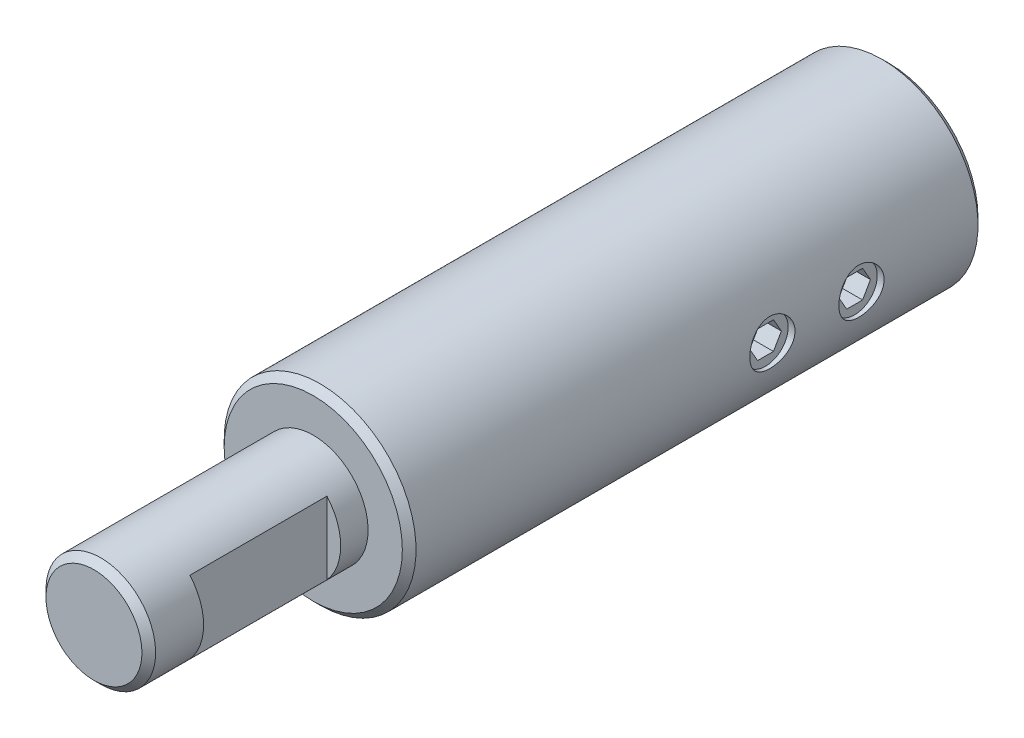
ISO-10303-21;
HEADER;
FILE_DESCRIPTION(('STEP AP214'),'2;1');
FILE_NAME('part.step','',(''),(''),'','','');
FILE_SCHEMA(('AUTOMOTIVE_DESIGN { 1 0 10303 214 1 1 1 1 }'));
ENDSEC;
DATA;
#1=APPLICATION_CONTEXT('core data for automotive mechanical design processes');
#2=APPLICATION_PROTOCOL_DEFINITION('international standard','automotive_design',2000,#1);
#3=PRODUCT_CONTEXT('',#1,'mechanical');
#4=PRODUCT('Part','Part','',(#3));
#5=PRODUCT_RELATED_PRODUCT_CATEGORY('part','',(#4));
#6=PRODUCT_DEFINITION_FORMATION('','',#4);
#7=PRODUCT_DEFINITION_CONTEXT('part definition',#1,'design');
#8=PRODUCT_DEFINITION('design','',#6,#7);
#9=PRODUCT_DEFINITION_SHAPE('','',#8);
#10=(LENGTH_UNIT() NAMED_UNIT(*) SI_UNIT(.MILLI.,.METRE.));
#11=(NAMED_UNIT(*) PLANE_ANGLE_UNIT() SI_UNIT($,.RADIAN.));
#12=(NAMED_UNIT(*) SI_UNIT($,.STERADIAN.) SOLID_ANGLE_UNIT());
#13=UNCERTAINTY_MEASURE_WITH_UNIT(LENGTH_MEASURE(1.E-05),#10,'distance_accuracy_value','');
#14=(GEOMETRIC_REPRESENTATION_CONTEXT(3) GLOBAL_UNCERTAINTY_ASSIGNED_CONTEXT((#13)) GLOBAL_UNIT_ASSIGNED_CONTEXT((#10,
#11,#12)) REPRESENTATION_CONTEXT('',''));
#15=CARTESIAN_POINT('',(0.,0.,0.));
#16=DIRECTION('',(0.,0.,1.));
#17=DIRECTION('',(1.,0.,0.));
#18=AXIS2_PLACEMENT_3D('',#15,#16,#17);
#19=CARTESIAN_POINT('',(5.,0.,10.1547005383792));
#20=DIRECTION('',(1.,0.,0.));
#21=DIRECTION('',(0.,1.,0.));
#22=AXIS2_PLACEMENT_3D('',#19,#20,#21);
#23=PLANE('',#22);
#24=DIRECTION('',(0.,-0.866025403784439,0.5));
#25=VECTOR('',#24,1.);
#26=CARTESIAN_POINT('',(5.,1.,9.57735026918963));
#27=LINE('',#26,#25);
#28=CARTESIAN_POINT('',(5.,1.,9.57735026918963));
#29=VERTEX_POINT('',#28);
#30=CARTESIAN_POINT('',(5.,0.,10.1547005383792));
#31=VERTEX_POINT('',#30);
#32=EDGE_CURVE('E117',#29,#31,#27,.T.);
#33=ORIENTED_EDGE('',*,*,#32,.T.);
#34=DIRECTION('',(0.,-0.866025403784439,-0.5));
#35=VECTOR('',#34,1.);
#36=CARTESIAN_POINT('',(5.,0.,10.1547005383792));
#37=LINE('',#36,#35);
#38=CARTESIAN_POINT('',(5.,-1.,9.57735026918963));
#39=VERTEX_POINT('',#38);
#40=EDGE_CURVE('E210',#31,#39,#37,.T.);
#41=ORIENTED_EDGE('',*,*,#40,.T.);
#42=DIRECTION('',(0.,0.,-1.));
#43=VECTOR('',#42,1.);
#44=CARTESIAN_POINT('',(5.,-1.,9.57735026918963));
#45=LINE('',#44,#43);
#46=CARTESIAN_POINT('',(5.,-1.,8.42264973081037));
#47=VERTEX_POINT('',#46);
#48=EDGE_CURVE('E213',#39,#47,#45,.T.);
#49=ORIENTED_EDGE('',*,*,#48,.T.);
#50=DIRECTION('',(0.,0.866025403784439,-0.5));
#51=VECTOR('',#50,1.);
#52=CARTESIAN_POINT('',(5.,-1.,8.42264973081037));
#53=LINE('',#52,#51);
#54=CARTESIAN_POINT('',(5.,0.,7.84529946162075));
#55=VERTEX_POINT('',#54);
#56=EDGE_CURVE('E216',#47,#55,#53,.T.);
#57=ORIENTED_EDGE('',*,*,#56,.T.);
#58=DIRECTION('',(0.,0.866025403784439,0.5));
#59=VECTOR('',#58,1.);
#60=CARTESIAN_POINT('',(5.,0.,7.84529946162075));
#61=LINE('',#60,#59);
#62=CARTESIAN_POINT('',(5.,1.,8.42264973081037));
#63=VERTEX_POINT('',#62);
#64=EDGE_CURVE('E218',#55,#63,#61,.T.);
#65=ORIENTED_EDGE('',*,*,#64,.T.);
#66=DIRECTION('',(0.,0.,1.));
#67=VECTOR('',#66,1.);
#68=CARTESIAN_POINT('',(5.,1.,8.42264973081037));
#69=LINE('',#68,#67);
#70=EDGE_CURVE('E142',#63,#29,#69,.T.);
#71=ORIENTED_EDGE('',*,*,#70,.T.);
#72=EDGE_LOOP('',(#33,#41,#49,#57,#65,#71));
#73=FACE_BOUND('',#72,.T.);
#74=ADVANCED_FACE('F14',(#73),#23,.T.);
#75=CARTESIAN_POINT('',(5.,0.,10.1547005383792));
#76=DIRECTION('',(0.,-0.5,0.866025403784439));
#77=DIRECTION('',(0.,-0.866025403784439,-0.5));
#78=AXIS2_PLACEMENT_3D('',#75,#76,#77);
#79=PLANE('',#78);
#80=DIRECTION('',(0.,-0.866025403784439,-0.5));
#81=VECTOR('',#80,1.);
#82=CARTESIAN_POINT('',(6.5,0.,10.1547005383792));
#83=LINE('',#82,#81);
#84=CARTESIAN_POINT('',(6.5,0.,10.1547005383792));
#85=VERTEX_POINT('',#84);
#86=CARTESIAN_POINT('',(6.5,-1.,9.57735026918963));
#87=VERTEX_POINT('',#86);
#88=EDGE_CURVE('E137',#85,#87,#83,.T.);
#89=ORIENTED_EDGE('',*,*,#88,.T.);
#90=DIRECTION('',(1.,0.,0.));
#91=VECTOR('',#90,1.);
#92=CARTESIAN_POINT('',(5.,-1.,9.57735026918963));
#93=LINE('',#92,#91);
#94=EDGE_CURVE('E156',#39,#87,#93,.T.);
#95=ORIENTED_EDGE('',*,*,#94,.F.);
#96=ORIENTED_EDGE('',*,*,#40,.F.);
#97=DIRECTION('',(1.,0.,0.));
#98=VECTOR('',#97,1.);
#99=CARTESIAN_POINT('',(5.,0.,10.1547005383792));
#100=LINE('',#99,#98);
#101=EDGE_CURVE('E158',#31,#85,#100,.T.);
#102=ORIENTED_EDGE('',*,*,#101,.T.);
#103=EDGE_LOOP('',(#89,#95,#96,#102));
#104=FACE_BOUND('',#103,.T.);
#105=ADVANCED_FACE('F225',(#104),#79,.F.);
#106=CARTESIAN_POINT('',(5.,-1.,9.57735026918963));
#107=DIRECTION('',(0.,-1.,0.));
#108=DIRECTION('',(1.,0.,0.));
#109=AXIS2_PLACEMENT_3D('',#106,#107,#108);
#110=PLANE('',#109);
#111=DIRECTION('',(0.,0.,-1.));
#112=VECTOR('',#111,1.);
#113=CARTESIAN_POINT('',(6.5,-1.,9.57735026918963));
#114=LINE('',#113,#112);
#115=CARTESIAN_POINT('',(6.5,-1.,8.42264973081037));
#116=VERTEX_POINT('',#115);
#117=EDGE_CURVE('E139',#87,#116,#114,.T.);
#118=ORIENTED_EDGE('',*,*,#117,.T.);
#119=DIRECTION('',(1.,0.,0.));
#120=VECTOR('',#119,1.);
#121=CARTESIAN_POINT('',(5.,-1.,8.42264973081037));
#122=LINE('',#121,#120);
#123=EDGE_CURVE('E154',#47,#116,#122,.T.);
#124=ORIENTED_EDGE('',*,*,#123,.F.);
#125=ORIENTED_EDGE('',*,*,#48,.F.);
#126=ORIENTED_EDGE('',*,*,#94,.T.);
#127=EDGE_LOOP('',(#118,#124,#125,#126));
#128=FACE_BOUND('',#127,.T.);
#129=ADVANCED_FACE('F227',(#128),#110,.F.);
#130=CARTESIAN_POINT('',(5.,-1.,8.42264973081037));
#131=DIRECTION('',(0.,-0.5,-0.866025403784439));
#132=DIRECTION('',(0.,0.866025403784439,-0.5));
#133=AXIS2_PLACEMENT_3D('',#130,#131,#132);
#134=PLANE('',#133);
#135=DIRECTION('',(0.,0.866025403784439,-0.5));
#136=VECTOR('',#135,1.);
#137=CARTESIAN_POINT('',(6.5,-1.,8.42264973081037));
#138=LINE('',#137,#136);
#139=CARTESIAN_POINT('',(6.5,0.,7.84529946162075));
#140=VERTEX_POINT('',#139);
#141=EDGE_CURVE('E147',#116,#140,#138,.T.);
#142=ORIENTED_EDGE('',*,*,#141,.T.);
#143=DIRECTION('',(1.,0.,0.));
#144=VECTOR('',#143,1.);
#145=CARTESIAN_POINT('',(5.,0.,7.84529946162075));
#146=LINE('',#145,#144);
#147=EDGE_CURVE('E152',#55,#140,#146,.T.);
#148=ORIENTED_EDGE('',*,*,#147,.F.);
#149=ORIENTED_EDGE('',*,*,#56,.F.);
#150=ORIENTED_EDGE('',*,*,#123,.T.);
#151=EDGE_LOOP('',(#142,#148,#149,#150));
#152=FACE_BOUND('',#151,.T.);
#153=ADVANCED_FACE('F231',(#152),#134,.F.);
#154=CARTESIAN_POINT('',(5.,0.,7.84529946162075));
#155=DIRECTION('',(0.,0.5,-0.866025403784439));
#156=DIRECTION('',(0.,0.866025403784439,0.5));
#157=AXIS2_PLACEMENT_3D('',#154,#155,#156);
#158=PLANE('',#157);
#159=DIRECTION('',(0.,0.866025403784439,0.5));
#160=VECTOR('',#159,1.);
#161=CARTESIAN_POINT('',(6.5,0.,7.84529946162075));
#162=LINE('',#161,#160);
#163=CARTESIAN_POINT('',(6.5,1.,8.42264973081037));
#164=VERTEX_POINT('',#163);
#165=EDGE_CURVE('E130',#140,#164,#162,.T.);
#166=ORIENTED_EDGE('',*,*,#165,.T.);
#167=DIRECTION('',(1.,0.,0.));
#168=VECTOR('',#167,1.);
#169=CARTESIAN_POINT('',(5.,1.,8.42264973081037));
#170=LINE('',#169,#168);
#171=EDGE_CURVE('E122',#63,#164,#170,.T.);
#172=ORIENTED_EDGE('',*,*,#171,.F.);
#173=ORIENTED_EDGE('',*,*,#64,.F.);
#174=ORIENTED_EDGE('',*,*,#147,.T.);
#175=EDGE_LOOP('',(#166,#172,#173,#174));
#176=FACE_BOUND('',#175,.T.);
#177=ADVANCED_FACE('F233',(#176),#158,.F.);
#178=CARTESIAN_POINT('',(5.,1.,8.42264973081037));
#179=DIRECTION('',(0.,1.,0.));
#180=DIRECTION('',(-1.,0.,0.));
#181=AXIS2_PLACEMENT_3D('',#178,#179,#180);
#182=PLANE('',#181);
#183=DIRECTION('',(0.,0.,1.));
#184=VECTOR('',#183,1.);
#185=CARTESIAN_POINT('',(6.5,1.,8.42264973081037));
#186=LINE('',#185,#184);
#187=CARTESIAN_POINT('',(6.5,1.,9.57735026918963));
#188=VERTEX_POINT('',#187);
#189=EDGE_CURVE('E125',#164,#188,#186,.T.);
#190=ORIENTED_EDGE('',*,*,#189,.T.);
#191=DIRECTION('',(1.,0.,0.));
#192=VECTOR('',#191,1.);
#193=CARTESIAN_POINT('',(5.,1.,9.57735026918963));
#194=LINE('',#193,#192);
#195=EDGE_CURVE('E110',#29,#188,#194,.T.);
#196=ORIENTED_EDGE('',*,*,#195,.F.);
#197=ORIENTED_EDGE('',*,*,#70,.F.);
#198=ORIENTED_EDGE('',*,*,#171,.T.);
#199=EDGE_LOOP('',(#190,#196,#197,#198));
#200=FACE_BOUND('',#199,.T.);
#201=ADVANCED_FACE('F126',(#200),#182,.F.);
#202=CARTESIAN_POINT('',(5.,1.,9.57735026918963));
#203=DIRECTION('',(0.,0.5,0.866025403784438));
#204=DIRECTION('',(0.,-0.866025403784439,0.5));
#205=AXIS2_PLACEMENT_3D('',#202,#203,#204);
#206=PLANE('',#205);
#207=DIRECTION('',(0.,-0.866025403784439,0.5));
#208=VECTOR('',#207,1.);
#209=CARTESIAN_POINT('',(6.5,1.,9.57735026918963));
#210=LINE('',#209,#208);
#211=EDGE_CURVE('E114',#188,#85,#210,.T.);
#212=ORIENTED_EDGE('',*,*,#211,.T.);
#213=ORIENTED_EDGE('',*,*,#101,.F.);
#214=ORIENTED_EDGE('',*,*,#32,.F.);
#215=ORIENTED_EDGE('',*,*,#195,.T.);
#216=EDGE_LOOP('',(#212,#213,#214,#215));
#217=FACE_BOUND('',#216,.T.);
#218=ADVANCED_FACE('F112',(#217),#206,.F.);
#219=CARTESIAN_POINT('',(6.5,0.,11.));
#220=DIRECTION('',(1.,0.,0.));
#221=DIRECTION('',(0.,0.,-1.));
#222=AXIS2_PLACEMENT_3D('',#219,#220,#221);
#223=PLANE('',#222);
#224=ORIENTED_EDGE('',*,*,#211,.F.);
#225=ORIENTED_EDGE('',*,*,#189,.F.);
#226=ORIENTED_EDGE('',*,*,#165,.F.);
#227=ORIENTED_EDGE('',*,*,#141,.F.);
#228=ORIENTED_EDGE('',*,*,#117,.F.);
#229=ORIENTED_EDGE('',*,*,#88,.F.);
#230=EDGE_LOOP('',(#224,#225,#226,#227,#228,#229));
#231=FACE_BOUND('',#230,.T.);
#232=CARTESIAN_POINT('',(6.5,0.,9.));
#233=DIRECTION('',(1.,0.,0.));
#234=DIRECTION('',(0.,1.,0.));
#235=AXIS2_PLACEMENT_3D('',#232,#233,#234);
#236=CIRCLE('',#235,1.65);
#237=CARTESIAN_POINT('',(6.5,1.65,9.));
#238=VERTEX_POINT('',#237);
#239=EDGE_CURVE('E394',#238,#238,#236,.F.);
#240=ORIENTED_EDGE('',*,*,#239,.F.);
#241=EDGE_LOOP('',(#240));
#242=FACE_BOUND('',#241,.T.);
#243=ADVANCED_FACE('F133',(#231,#242),#223,.T.);
#244=CARTESIAN_POINT('',(2.5,0.,9.));
#245=DIRECTION('',(-1.,0.,0.));
#246=DIRECTION('',(0.,0.,1.));
#247=AXIS2_PLACEMENT_3D('',#244,#245,#246);
#248=CYLINDRICAL_SURFACE('',#247,2.);
#249=CARTESIAN_POINT('',(3.25,0.,9.));
#250=DIRECTION('',(-1.,0.,0.));
#251=DIRECTION('',(0.,0.,1.));
#252=AXIS2_PLACEMENT_3D('',#249,#250,#251);
#253=CIRCLE('',#252,2.);
#254=CARTESIAN_POINT('',(3.25,0.,11.));
#255=VERTEX_POINT('',#254);
#256=EDGE_CURVE('E121',#255,#255,#253,.T.);
#257=ORIENTED_EDGE('',*,*,#256,.F.);
#258=EDGE_LOOP('',(#257));
#259=FACE_BOUND('',#258,.T.);
#260=CARTESIAN_POINT('',(4.,0.,11.));
#261=CARTESIAN_POINT('',(3.99999426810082,-0.105143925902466,10.9999933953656));
#262=CARTESIAN_POINT('',(3.99580982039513,-0.210413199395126,10.9916598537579));
#263=CARTESIAN_POINT('',(3.97948312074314,-0.417840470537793,10.9586942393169));
#264=CARTESIAN_POINT('',(3.96732575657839,-0.519992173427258,10.9340312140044));
#265=CARTESIAN_POINT('',(3.93632558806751,-0.717867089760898,10.8696123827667));
#266=CARTESIAN_POINT('',(3.91750878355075,-0.813613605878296,10.8299152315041));
#267=CARTESIAN_POINT('',(3.87491553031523,-0.996945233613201,10.73685875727));
#268=CARTESIAN_POINT('',(3.85113947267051,-1.08453098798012,10.6835005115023));
#269=CARTESIAN_POINT('',(3.79912516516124,-1.25501563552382,10.5609655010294));
#270=CARTESIAN_POINT('',(3.77070398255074,-1.33731042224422,10.4910270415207));
#271=CARTESIAN_POINT('',(3.71319940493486,-1.48955888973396,10.3389570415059));
#272=CARTESIAN_POINT('',(3.68411552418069,-1.55950316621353,10.2568162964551));
#273=CARTESIAN_POINT('',(3.62597902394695,-1.69050400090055,10.0750333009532));
#274=CARTESIAN_POINT('',(3.59710373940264,-1.75045067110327,9.97452780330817));
#275=CARTESIAN_POINT('',(3.54571957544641,-1.85233645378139,9.76326532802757));
#276=CARTESIAN_POINT('',(3.52320615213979,-1.89428842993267,9.6525157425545));
#277=CARTESIAN_POINT('',(3.48915734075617,-1.95626488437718,9.43066978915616));
#278=CARTESIAN_POINT('',(3.47704543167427,-1.97745171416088,9.31999109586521));
#279=CARTESIAN_POINT('',(3.46363779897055,-2.00085398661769,9.09604232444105));
#280=CARTESIAN_POINT('',(3.46233138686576,-2.00308817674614,8.98277491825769));
#281=CARTESIAN_POINT('',(3.47021860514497,-1.98937457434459,8.77142795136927));
#282=CARTESIAN_POINT('',(3.47817527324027,-1.97556911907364,8.6731519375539));
#283=CARTESIAN_POINT('',(3.50152457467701,-1.93387969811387,8.48055618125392));
#284=CARTESIAN_POINT('',(3.51691957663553,-1.9059912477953,8.38623770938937));
#285=CARTESIAN_POINT('',(3.55374952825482,-1.83641956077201,8.20154173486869));
#286=CARTESIAN_POINT('',(3.57531681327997,-1.79443013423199,8.11130720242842));
#287=CARTESIAN_POINT('',(3.62206808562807,-1.69808337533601,7.93873141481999));
#288=CARTESIAN_POINT('',(3.64725369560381,-1.64372048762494,7.85639372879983));
#289=CARTESIAN_POINT('',(3.70226315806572,-1.51613210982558,7.69095749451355));
#290=CARTESIAN_POINT('',(3.73227020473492,-1.44138891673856,7.60908625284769));
#291=CARTESIAN_POINT('',(3.79095246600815,-1.27911115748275,7.4585291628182));
#292=CARTESIAN_POINT('',(3.81962703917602,-1.19157051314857,7.38984961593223));
#293=CARTESIAN_POINT('',(3.87403974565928,-1.0010330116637,7.26462867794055));
#294=CARTESIAN_POINT('',(3.89957968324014,-0.897507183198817,7.20879905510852));
#295=CARTESIAN_POINT('',(3.94315762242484,-0.680932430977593,7.11580594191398));
#296=CARTESIAN_POINT('',(3.96120157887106,-0.567891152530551,7.07862762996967));
#297=CARTESIAN_POINT('',(3.98648667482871,-0.345532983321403,7.02704919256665));
#298=CARTESIAN_POINT('',(3.9944987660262,-0.236683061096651,7.01101752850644));
#299=CARTESIAN_POINT('',(4.00146026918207,-0.0175591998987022,6.99707053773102));
#300=CARTESIAN_POINT('',(4.00041397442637,0.0927140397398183,6.99914662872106));
#301=CARTESIAN_POINT('',(3.9898238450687,0.302465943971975,7.02041337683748));
#302=CARTESIAN_POINT('',(3.98094491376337,0.402118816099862,7.03826506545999));
#303=CARTESIAN_POINT('',(3.9564434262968,0.596813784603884,7.08847614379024));
#304=CARTESIAN_POINT('',(3.94082012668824,0.691855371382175,7.12083713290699));
#305=CARTESIAN_POINT('',(3.90368502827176,0.877777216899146,7.19999693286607));
#306=CARTESIAN_POINT('',(3.88201763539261,0.968460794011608,7.24718210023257));
#307=CARTESIAN_POINT('',(3.83487948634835,1.14092272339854,7.35421507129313));
#308=CARTESIAN_POINT('',(3.80940711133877,1.22269725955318,7.41406826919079));
#309=CARTESIAN_POINT('',(3.75416442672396,1.38353537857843,7.55152085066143));
#310=CARTESIAN_POINT('',(3.72421769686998,1.46154415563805,7.63028573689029));
#311=CARTESIAN_POINT('',(3.6652478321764,1.60371264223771,7.79985030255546));
#312=CARTESIAN_POINT('',(3.63622534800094,1.66786277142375,7.89065823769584));
#313=CARTESIAN_POINT('',(3.58102384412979,1.78341582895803,8.08728730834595));
#314=CARTESIAN_POINT('',(3.55505059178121,1.8340509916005,8.19362253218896));
#315=CARTESIAN_POINT('',(3.51148144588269,1.91616565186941,8.41502013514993));
#316=CARTESIAN_POINT('',(3.493874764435,1.94766983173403,8.53007105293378));
#317=CARTESIAN_POINT('',(3.47123002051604,1.98772337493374,8.75382044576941));
#318=CARTESIAN_POINT('',(3.4651476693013,1.9981859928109,8.86206850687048));
#319=CARTESIAN_POINT('',(3.46330709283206,2.00137830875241,9.07889413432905));
#320=CARTESIAN_POINT('',(3.4675443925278,1.99411569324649,9.18747153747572));
#321=CARTESIAN_POINT('',(3.48475724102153,1.96385225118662,9.39096700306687));
#322=CARTESIAN_POINT('',(3.49686188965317,1.94241662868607,9.48620094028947));
#323=CARTESIAN_POINT('',(3.52742032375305,1.88635071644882,9.67161623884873));
#324=CARTESIAN_POINT('',(3.54587615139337,1.85171618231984,9.76179596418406));
#325=CARTESIAN_POINT('',(3.58857060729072,1.76763149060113,9.94124970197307));
#326=CARTESIAN_POINT('',(3.61311444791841,1.7173422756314,10.0300558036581));
#327=CARTESIAN_POINT('',(3.66470663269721,1.60430194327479,10.1985490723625));
#328=CARTESIAN_POINT('',(3.69175627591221,1.54154434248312,10.2782314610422));
#329=CARTESIAN_POINT('',(3.74924646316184,1.39640665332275,10.4362839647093));
#330=CARTESIAN_POINT('',(3.77969966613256,1.31256884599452,10.5133182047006));
#331=CARTESIAN_POINT('',(3.83755504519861,1.1323096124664,10.6525259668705));
#332=CARTESIAN_POINT('',(3.8649555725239,1.0358814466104,10.7146914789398));
#333=CARTESIAN_POINT('',(3.91396019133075,0.83186319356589,10.8224727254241));
#334=CARTESIAN_POINT('',(3.93552192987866,0.724199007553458,10.8679683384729));
#335=CARTESIAN_POINT('',(3.97002682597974,0.501484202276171,10.9396163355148));
#336=CARTESIAN_POINT('',(3.98299446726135,0.386455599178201,10.9658236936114));
#337=CARTESIAN_POINT('',(3.99390923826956,0.225203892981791,10.9877948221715));
#338=CARTESIAN_POINT('',(3.99618730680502,0.180323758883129,10.9923652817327));
#339=CARTESIAN_POINT('',(3.99923393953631,0.0903034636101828,10.9984693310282));
#340=CARTESIAN_POINT('',(4.00000246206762,0.0451632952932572,11.0000028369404));
#341=CARTESIAN_POINT('',(4.,0.,11.));
#342=B_SPLINE_CURVE_WITH_KNOTS('',3,(#260,#261,#262,#263,#264,#265,#266,#267,#268,#269,#270,
#271,#272,#273,#274,#275,#276,#277,#278,#279,#280,#281,#282,#283,#284,#285,#286,#287,#288,#289,
#290,#291,#292,#293,#294,#295,#296,#297,#298,#299,#300,#301,#302,#303,#304,#305,#306,#307,#308,
#309,#310,#311,#312,#313,#314,#315,#316,#317,#318,#319,#320,#321,#322,#323,#324,#325,#326,#327,
#328,#329,#330,#331,#332,#333,#334,#335,#336,#337,#338,#339,#340,#341),.UNSPECIFIED.,.T.,.F.,(4,
2,2,2,2,2,2,2,2,2,2,2,2,2,2,2,2,2,2,2,2,2,2,2,2,2,2,2,2,2,2,2,2,2,2,2,2,2,2,2,4),(0.,
0.315248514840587,0.631096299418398,0.9457243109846,1.26032752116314,1.59396351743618,
1.92785247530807,2.28763452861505,2.64715895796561,2.98516024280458,3.3228271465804,
3.6201142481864,3.91749607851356,4.22180480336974,4.52625042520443,4.86929882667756,
5.21251069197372,5.57166044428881,5.93052433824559,6.25966580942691,6.58865129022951,
6.89213813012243,7.19565843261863,7.50785712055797,7.82018901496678,8.16319221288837,
8.50643177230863,8.86629364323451,9.22569023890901,9.55058615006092,9.87534119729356,
10.1691586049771,10.463070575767,10.7767291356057,11.0905512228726,11.4425048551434,
11.7946476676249,12.1492802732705,12.502898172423,12.6383056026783,12.7737167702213),.UNSPECIFIED.);
#343=CARTESIAN_POINT('',(4.,0.,11.));
#344=VERTEX_POINT('',#343);
#345=EDGE_CURVE('E24',#344,#344,#342,.T.);
#346=ORIENTED_EDGE('',*,*,#345,.F.);
#347=EDGE_LOOP('',(#346));
#348=FACE_BOUND('',#347,.T.);
#349=ADVANCED_FACE('F317',(#259,#348),#248,.T.);
#350=CARTESIAN_POINT('',(2.5,0.,9.));
#351=DIRECTION('',(-1.,0.,0.));
#352=DIRECTION('',(0.,0.,1.));
#353=AXIS2_PLACEMENT_3D('',#350,#351,#352);
#354=PLANE('',#353);
#355=CARTESIAN_POINT('',(2.5,0.,9.));
#356=DIRECTION('',(-1.,0.,0.));
#357=DIRECTION('',(0.,0.,1.));
#358=AXIS2_PLACEMENT_3D('',#355,#356,#357);
#359=CIRCLE('',#358,1.25);
#360=CARTESIAN_POINT('',(2.5,0.,10.25));
#361=VERTEX_POINT('',#360);
#362=EDGE_CURVE('E18',#361,#361,#359,.T.);
#363=ORIENTED_EDGE('',*,*,#362,.T.);
#364=EDGE_LOOP('',(#363));
#365=FACE_BOUND('',#364,.T.);
#366=ADVANCED_FACE('F16',(#365),#354,.T.);
#367=CARTESIAN_POINT('',(2.5,0.,9.));
#368=DIRECTION('',(1.,0.,0.));
#369=DIRECTION('',(0.,0.,-1.));
#370=AXIS2_PLACEMENT_3D('',#367,#368,#369);
#371=CONICAL_SURFACE('',#370,1.25,0.78539816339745);
#372=ORIENTED_EDGE('',*,*,#256,.T.);
#373=EDGE_LOOP('',(#372));
#374=FACE_BOUND('',#373,.T.);
#375=ORIENTED_EDGE('',*,*,#362,.F.);
#376=EDGE_LOOP('',(#375));
#377=FACE_BOUND('',#376,.T.);
#378=ADVANCED_FACE('F288',(#374,#377),#371,.T.);
#379=CARTESIAN_POINT('',(5.,-1.,14.9226497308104));
#380=DIRECTION('',(1.,0.,0.));
#381=DIRECTION('',(0.,-0.5,0.866025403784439));
#382=AXIS2_PLACEMENT_3D('',#379,#380,#381);
#383=PLANE('',#382);
#384=DIRECTION('',(0.,0.,-1.));
#385=VECTOR('',#384,1.);
#386=CARTESIAN_POINT('',(5.,-1.,16.0773502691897));
#387=LINE('',#386,#385);
#388=CARTESIAN_POINT('',(5.,-1.,16.0773502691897));
#389=VERTEX_POINT('',#388);
#390=CARTESIAN_POINT('',(5.,-1.,14.9226497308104));
#391=VERTEX_POINT('',#390);
#392=EDGE_CURVE('E189',#389,#391,#387,.T.);
#393=ORIENTED_EDGE('',*,*,#392,.T.);
#394=DIRECTION('',(0.,0.866025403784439,-0.5));
#395=VECTOR('',#394,1.);
#396=CARTESIAN_POINT('',(5.,-1.,14.9226497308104));
#397=LINE('',#396,#395);
#398=CARTESIAN_POINT('',(5.,0.,14.3452994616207));
#399=VERTEX_POINT('',#398);
#400=EDGE_CURVE('E722',#391,#399,#397,.T.);
#401=ORIENTED_EDGE('',*,*,#400,.T.);
#402=DIRECTION('',(0.,0.866025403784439,0.5));
#403=VECTOR('',#402,1.);
#404=CARTESIAN_POINT('',(5.,0.,14.3452994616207));
#405=LINE('',#404,#403);
#406=CARTESIAN_POINT('',(5.,1.,14.9226497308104));
#407=VERTEX_POINT('',#406);
#408=EDGE_CURVE('E725',#399,#407,#405,.T.);
#409=ORIENTED_EDGE('',*,*,#408,.T.);
#410=DIRECTION('',(0.,0.,1.));
#411=VECTOR('',#410,1.);
#412=CARTESIAN_POINT('',(5.,1.,14.9226497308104));
#413=LINE('',#412,#411);
#414=CARTESIAN_POINT('',(5.,1.,16.0773502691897));
#415=VERTEX_POINT('',#414);
#416=EDGE_CURVE('E728',#407,#415,#413,.T.);
#417=ORIENTED_EDGE('',*,*,#416,.T.);
#418=DIRECTION('',(0.,-0.866025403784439,0.5));
#419=VECTOR('',#418,1.);
#420=CARTESIAN_POINT('',(5.,1.,16.0773502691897));
#421=LINE('',#420,#419);
#422=CARTESIAN_POINT('',(5.,0.,16.6547005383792));
#423=VERTEX_POINT('',#422);
#424=EDGE_CURVE('E730',#415,#423,#421,.T.);
#425=ORIENTED_EDGE('',*,*,#424,.T.);
#426=DIRECTION('',(0.,-0.866025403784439,-0.5));
#427=VECTOR('',#426,1.);
#428=CARTESIAN_POINT('',(5.,0.,16.6547005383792));
#429=LINE('',#428,#427);
#430=EDGE_CURVE('E175',#423,#389,#429,.T.);
#431=ORIENTED_EDGE('',*,*,#430,.T.);
#432=EDGE_LOOP('',(#393,#401,#409,#417,#425,#431));
#433=FACE_BOUND('',#432,.T.);
#434=ADVANCED_FACE('F284',(#433),#383,.T.);
#435=CARTESIAN_POINT('',(5.,-1.,14.9226497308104));
#436=DIRECTION('',(0.,-0.5,-0.866025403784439));
#437=DIRECTION('',(0.,0.866025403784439,-0.5));
#438=AXIS2_PLACEMENT_3D('',#435,#436,#437);
#439=PLANE('',#438);
#440=DIRECTION('',(0.,0.866025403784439,-0.5));
#441=VECTOR('',#440,1.);
#442=CARTESIAN_POINT('',(6.5,-1.,14.9226497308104));
#443=LINE('',#442,#441);
#444=CARTESIAN_POINT('',(6.5,-1.,14.9226497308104));
#445=VERTEX_POINT('',#444);
#446=CARTESIAN_POINT('',(6.5,0.,14.3452994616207));
#447=VERTEX_POINT('',#446);
#448=EDGE_CURVE('E166',#445,#447,#443,.T.);
#449=ORIENTED_EDGE('',*,*,#448,.T.);
#450=DIRECTION('',(1.,0.,0.));
#451=VECTOR('',#450,1.);
#452=CARTESIAN_POINT('',(5.,0.,14.3452994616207));
#453=LINE('',#452,#451);
#454=EDGE_CURVE('E199',#399,#447,#453,.T.);
#455=ORIENTED_EDGE('',*,*,#454,.F.);
#456=ORIENTED_EDGE('',*,*,#400,.F.);
#457=DIRECTION('',(1.,0.,0.));
#458=VECTOR('',#457,1.);
#459=CARTESIAN_POINT('',(5.,-1.,14.9226497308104));
#460=LINE('',#459,#458);
#461=EDGE_CURVE('E201',#391,#445,#460,.T.);
#462=ORIENTED_EDGE('',*,*,#461,.T.);
#463=EDGE_LOOP('',(#449,#455,#456,#462));
#464=FACE_BOUND('',#463,.T.);
#465=ADVANCED_FACE('F287',(#464),#439,.F.);
#466=CARTESIAN_POINT('',(5.,0.,14.3452994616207));
#467=DIRECTION('',(0.,0.5,-0.866025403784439));
#468=DIRECTION('',(1.,0.,0.));
#469=AXIS2_PLACEMENT_3D('',#466,#467,#468);
#470=PLANE('',#469);
#471=DIRECTION('',(0.,0.866025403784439,0.5));
#472=VECTOR('',#471,1.);
#473=CARTESIAN_POINT('',(6.5,0.,14.3452994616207));
#474=LINE('',#473,#472);
#475=CARTESIAN_POINT('',(6.5,1.,14.9226497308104));
#476=VERTEX_POINT('',#475);
#477=EDGE_CURVE('E172',#447,#476,#474,.T.);
#478=ORIENTED_EDGE('',*,*,#477,.T.);
#479=DIRECTION('',(1.,0.,0.));
#480=VECTOR('',#479,1.);
#481=CARTESIAN_POINT('',(5.,1.,14.9226497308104));
#482=LINE('',#481,#480);
#483=EDGE_CURVE('E197',#407,#476,#482,.T.);
#484=ORIENTED_EDGE('',*,*,#483,.F.);
#485=ORIENTED_EDGE('',*,*,#408,.F.);
#486=ORIENTED_EDGE('',*,*,#454,.T.);
#487=EDGE_LOOP('',(#478,#484,#485,#486));
#488=FACE_BOUND('',#487,.T.);
#489=ADVANCED_FACE('F302',(#488),#470,.F.);
#490=CARTESIAN_POINT('',(5.,1.,14.9226497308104));
#491=DIRECTION('',(0.,1.,0.));
#492=DIRECTION('',(0.,0.,1.));
#493=AXIS2_PLACEMENT_3D('',#490,#491,#492);
#494=PLANE('',#493);
#495=DIRECTION('',(0.,0.,1.));
#496=VECTOR('',#495,1.);
#497=CARTESIAN_POINT('',(6.5,1.,14.9226497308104));
#498=LINE('',#497,#496);
#499=CARTESIAN_POINT('',(6.5,1.,16.0773502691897));
#500=VERTEX_POINT('',#499);
#501=EDGE_CURVE('E180',#476,#500,#498,.T.);
#502=ORIENTED_EDGE('',*,*,#501,.T.);
#503=DIRECTION('',(1.,0.,0.));
#504=VECTOR('',#503,1.);
#505=CARTESIAN_POINT('',(5.,1.,16.0773502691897));
#506=LINE('',#505,#504);
#507=EDGE_CURVE('E195',#415,#500,#506,.T.);
#508=ORIENTED_EDGE('',*,*,#507,.F.);
#509=ORIENTED_EDGE('',*,*,#416,.F.);
#510=ORIENTED_EDGE('',*,*,#483,.T.);
#511=EDGE_LOOP('',(#502,#508,#509,#510));
#512=FACE_BOUND('',#511,.T.);
#513=ADVANCED_FACE('F298',(#512),#494,.F.);
#514=CARTESIAN_POINT('',(5.,1.,16.0773502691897));
#515=DIRECTION('',(0.,0.5,0.866025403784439));
#516=DIRECTION('',(0.,-0.866025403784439,0.5));
#517=AXIS2_PLACEMENT_3D('',#514,#515,#516);
#518=PLANE('',#517);
#519=DIRECTION('',(0.,-0.866025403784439,0.5));
#520=VECTOR('',#519,1.);
#521=CARTESIAN_POINT('',(6.5,1.,16.0773502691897));
#522=LINE('',#521,#520);
#523=CARTESIAN_POINT('',(6.5,0.,16.6547005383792));
#524=VERTEX_POINT('',#523);
#525=EDGE_CURVE('E183',#500,#524,#522,.T.);
#526=ORIENTED_EDGE('',*,*,#525,.T.);
#527=DIRECTION('',(1.,0.,0.));
#528=VECTOR('',#527,1.);
#529=CARTESIAN_POINT('',(5.,0.,16.6547005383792));
#530=LINE('',#529,#528);
#531=EDGE_CURVE('E193',#423,#524,#530,.T.);
#532=ORIENTED_EDGE('',*,*,#531,.F.);
#533=ORIENTED_EDGE('',*,*,#424,.F.);
#534=ORIENTED_EDGE('',*,*,#507,.T.);
#535=EDGE_LOOP('',(#526,#532,#533,#534));
#536=FACE_BOUND('',#535,.T.);
#537=ADVANCED_FACE('F294',(#536),#518,.F.);
#538=CARTESIAN_POINT('',(5.,0.,16.6547005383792));
#539=DIRECTION('',(0.,-0.5,0.866025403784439));
#540=DIRECTION('',(-1.,0.,0.));
#541=AXIS2_PLACEMENT_3D('',#538,#539,#540);
#542=PLANE('',#541);
#543=DIRECTION('',(0.,-0.866025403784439,-0.5));
#544=VECTOR('',#543,1.);
#545=CARTESIAN_POINT('',(6.5,0.,16.6547005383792));
#546=LINE('',#545,#544);
#547=CARTESIAN_POINT('',(6.5,-1.,16.0773502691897));
#548=VERTEX_POINT('',#547);
#549=EDGE_CURVE('E186',#524,#548,#546,.T.);
#550=ORIENTED_EDGE('',*,*,#549,.T.);
#551=DIRECTION('',(1.,0.,0.));
#552=VECTOR('',#551,1.);
#553=CARTESIAN_POINT('',(5.,-1.,16.0773502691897));
#554=LINE('',#553,#552);
#555=EDGE_CURVE('E190',#389,#548,#554,.T.);
#556=ORIENTED_EDGE('',*,*,#555,.F.);
#557=ORIENTED_EDGE('',*,*,#430,.F.);
#558=ORIENTED_EDGE('',*,*,#531,.T.);
#559=EDGE_LOOP('',(#550,#556,#557,#558));
#560=FACE_BOUND('',#559,.T.);
#561=ADVANCED_FACE('F290',(#560),#542,.F.);
#562=CARTESIAN_POINT('',(5.,-1.,16.0773502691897));
#563=DIRECTION('',(0.,-1.,0.));
#564=DIRECTION('',(0.,0.,-1.));
#565=AXIS2_PLACEMENT_3D('',#562,#563,#564);
#566=PLANE('',#565);
#567=DIRECTION('',(0.,0.,-1.));
#568=VECTOR('',#567,1.);
#569=CARTESIAN_POINT('',(6.5,-1.,16.0773502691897));
#570=LINE('',#569,#568);
#571=EDGE_CURVE('E163',#548,#445,#570,.T.);
#572=ORIENTED_EDGE('',*,*,#571,.T.);
#573=ORIENTED_EDGE('',*,*,#461,.F.);
#574=ORIENTED_EDGE('',*,*,#392,.F.);
#575=ORIENTED_EDGE('',*,*,#555,.T.);
#576=EDGE_LOOP('',(#572,#573,#574,#575));
#577=FACE_BOUND('',#576,.T.);
#578=ADVANCED_FACE('F293',(#577),#566,.F.);
#579=CARTESIAN_POINT('',(6.5,-1.73205080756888,14.5));
#580=DIRECTION('',(1.,0.,0.));
#581=DIRECTION('',(0.,0.866025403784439,0.5));
#582=AXIS2_PLACEMENT_3D('',#579,#580,#581);
#583=PLANE('',#582);
#584=ORIENTED_EDGE('',*,*,#571,.F.);
#585=ORIENTED_EDGE('',*,*,#549,.F.);
#586=ORIENTED_EDGE('',*,*,#525,.F.);
#587=ORIENTED_EDGE('',*,*,#501,.F.);
#588=ORIENTED_EDGE('',*,*,#477,.F.);
#589=ORIENTED_EDGE('',*,*,#448,.F.);
#590=EDGE_LOOP('',(#584,#585,#586,#587,#588,#589));
#591=FACE_BOUND('',#590,.T.);
#592=CARTESIAN_POINT('',(6.5,0.,15.5));
#593=DIRECTION('',(1.,0.,0.));
#594=DIRECTION('',(0.,0.,1.));
#595=AXIS2_PLACEMENT_3D('',#592,#593,#594);
#596=CIRCLE('',#595,1.65);
#597=CARTESIAN_POINT('',(6.5,0.,17.15));
#598=VERTEX_POINT('',#597);
#599=EDGE_CURVE('E396',#598,#598,#596,.F.);
#600=ORIENTED_EDGE('',*,*,#599,.F.);
#601=EDGE_LOOP('',(#600));
#602=FACE_BOUND('',#601,.T.);
#603=ADVANCED_FACE('F312',(#591,#602),#583,.T.);
#604=CARTESIAN_POINT('',(2.5,0.,15.5));
#605=DIRECTION('',(-1.,0.,0.));
#606=DIRECTION('',(0.,-0.866025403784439,-0.5));
#607=AXIS2_PLACEMENT_3D('',#604,#605,#606);
#608=CYLINDRICAL_SURFACE('',#607,2.);
#609=CARTESIAN_POINT('',(3.25,0.,15.5));
#610=DIRECTION('',(-1.,0.,0.));
#611=DIRECTION('',(0.,-0.866025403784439,-0.5));
#612=AXIS2_PLACEMENT_3D('',#609,#610,#611);
#613=CIRCLE('',#612,2.);
#614=CARTESIAN_POINT('',(3.25,-1.73205080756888,14.5));
#615=VERTEX_POINT('',#614);
#616=EDGE_CURVE('E192',#615,#615,#613,.T.);
#617=ORIENTED_EDGE('',*,*,#616,.F.);
#618=EDGE_LOOP('',(#617));
#619=FACE_BOUND('',#618,.T.);
#620=CARTESIAN_POINT('',(3.60555127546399,-1.73205080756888,14.5));
#621=CARTESIAN_POINT('',(3.63330072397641,-1.6742839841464,14.3999492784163));
#622=CARTESIAN_POINT('',(3.66340889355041,-1.60804520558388,14.3052717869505));
#623=CARTESIAN_POINT('',(3.72473015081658,-1.46040741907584,14.1286809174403));
#624=CARTESIAN_POINT('',(3.75594606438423,-1.37896698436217,14.0468035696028));
#625=CARTESIAN_POINT('',(3.81605659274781,-1.20265571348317,13.8978365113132));
#626=CARTESIAN_POINT('',(3.84495025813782,-1.10777942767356,13.8307528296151));
#627=CARTESIAN_POINT('',(3.8972467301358,-0.906764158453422,13.713583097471));
#628=CARTESIAN_POINT('',(3.92065575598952,-0.800638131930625,13.6634777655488));
#629=CARTESIAN_POINT('',(3.9585333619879,-0.584425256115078,13.583973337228));
#630=CARTESIAN_POINT('',(3.97332921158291,-0.474679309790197,13.5538093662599));
#631=CARTESIAN_POINT('',(3.99370450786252,-0.250836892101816,13.5125375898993));
#632=CARTESIAN_POINT('',(3.99928959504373,-0.136743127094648,13.5014181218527));
#633=CARTESIAN_POINT('',(4.00052059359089,0.0805769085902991,13.498961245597));
#634=CARTESIAN_POINT('',(3.99707902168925,0.183782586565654,13.5058076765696));
#635=CARTESIAN_POINT('',(3.98250691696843,0.387363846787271,13.5351783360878));
#636=CARTESIAN_POINT('',(3.97137663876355,0.487739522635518,13.5577020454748));
#637=CARTESIAN_POINT('',(3.94266442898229,0.681856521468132,13.6171121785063));
#638=CARTESIAN_POINT('',(3.92515694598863,0.775660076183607,13.6538331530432));
#639=CARTESIAN_POINT('',(3.88520912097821,0.955865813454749,13.740363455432));
#640=CARTESIAN_POINT('',(3.86276744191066,1.04226598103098,13.7901763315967));
#641=CARTESIAN_POINT('',(3.812752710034,1.21304818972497,13.9062456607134));
#642=CARTESIAN_POINT('',(3.78490681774,1.29664921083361,13.9735328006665));
#643=CARTESIAN_POINT('',(3.72810667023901,1.45191920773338,14.1203750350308));
#644=CARTESIAN_POINT('',(3.69915157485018,1.52357890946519,14.1999395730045));
#645=CARTESIAN_POINT('',(3.64057503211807,1.65894331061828,14.3769158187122));
#646=CARTESIAN_POINT('',(3.61109645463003,1.72150029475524,14.4752592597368));
#647=CARTESIAN_POINT('',(3.55783946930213,1.82904300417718,14.6825566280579));
#648=CARTESIAN_POINT('',(3.53405805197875,1.87403801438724,14.7915049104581));
#649=CARTESIAN_POINT('',(3.49672204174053,1.94278435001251,15.0118752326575));
#650=CARTESIAN_POINT('',(3.48273910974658,1.96743518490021,15.1229400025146));
#651=CARTESIAN_POINT('',(3.46560346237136,1.9974778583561,15.348415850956));
#652=CARTESIAN_POINT('',(3.46243843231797,2.00289159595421,15.4628229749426));
#653=CARTESIAN_POINT('',(3.46715158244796,1.99470641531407,15.6764682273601));
#654=CARTESIAN_POINT('',(3.47371297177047,1.98337510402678,15.7758331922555));
#655=CARTESIAN_POINT('',(3.49462495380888,1.946289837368,15.9709823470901));
#656=CARTESIAN_POINT('',(3.50897787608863,1.92053156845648,16.0667654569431));
#657=CARTESIAN_POINT('',(3.54385710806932,1.85538137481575,16.2532657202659));
#658=CARTESIAN_POINT('',(3.56443473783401,1.81587568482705,16.3439330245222));
#659=CARTESIAN_POINT('',(3.60953060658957,1.72449452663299,16.5177271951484));
#660=CARTESIAN_POINT('',(3.63405047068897,1.67261395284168,16.6008509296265));
#661=CARTESIAN_POINT('',(3.687995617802,1.55038171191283,16.7682096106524));
#662=CARTESIAN_POINT('',(3.71765053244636,1.47852991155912,16.851277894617));
#663=CARTESIAN_POINT('',(3.77614005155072,1.32202408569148,17.0047503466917));
#664=CARTESIAN_POINT('',(3.80497420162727,1.23736312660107,17.0751476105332));
#665=CARTESIAN_POINT('',(3.86059866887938,1.05152767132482,17.2052515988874));
#666=CARTESIAN_POINT('',(3.88717160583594,0.949677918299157,17.2640950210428));
#667=CARTESIAN_POINT('',(3.93323680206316,0.735911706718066,17.3634093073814));
#668=CARTESIAN_POINT('',(3.95273415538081,0.62400256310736,17.4038933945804));
#669=CARTESIAN_POINT('',(3.98116274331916,0.402329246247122,17.4622059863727));
#670=CARTESIAN_POINT('',(3.99078295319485,0.293045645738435,17.481519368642));
#671=CARTESIAN_POINT('',(4.00086617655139,0.0723913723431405,17.5017526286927));
#672=CARTESIAN_POINT('',(4.00133422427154,-0.038978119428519,17.502682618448));
#673=CARTESIAN_POINT('',(3.99342511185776,-0.25068414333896,17.4868259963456));
#674=CARTESIAN_POINT('',(3.98578495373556,-0.351163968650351,17.471515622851));
#675=CARTESIAN_POINT('',(3.96353354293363,-0.547910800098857,17.4261329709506));
#676=CARTESIAN_POINT('',(3.94892168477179,-0.644177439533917,17.3960594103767));
#677=CARTESIAN_POINT('',(3.913702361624,-0.832015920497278,17.321581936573));
#678=CARTESIAN_POINT('',(3.89298402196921,-0.923460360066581,17.2769111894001));
#679=CARTESIAN_POINT('',(3.84746038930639,-1.09780664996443,17.1748245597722));
#680=CARTESIAN_POINT('',(3.8226535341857,-1.18070521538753,17.1174038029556));
#681=CARTESIAN_POINT('',(3.76849034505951,-1.34409113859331,16.9850945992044));
#682=CARTESIAN_POINT('',(3.73892591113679,-1.42358048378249,16.9090575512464));
#683=CARTESIAN_POINT('',(3.68019570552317,-1.5691832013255,16.7448764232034));
#684=CARTESIAN_POINT('',(3.65103025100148,-1.63528645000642,16.6567232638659));
#685=CARTESIAN_POINT('',(3.59461952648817,-1.75596318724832,16.4644712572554));
#686=CARTESIAN_POINT('',(3.5675848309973,-1.80964162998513,16.3597429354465));
#687=CARTESIAN_POINT('',(3.52130272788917,-1.89814384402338,16.1410325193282));
#688=CARTESIAN_POINT('',(3.5020458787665,-1.932990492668,16.027061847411));
#689=CARTESIAN_POINT('',(3.47575396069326,-1.97984906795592,15.8034753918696));
#690=CARTESIAN_POINT('',(3.46781075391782,-1.99356608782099,15.6943271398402));
#691=CARTESIAN_POINT('',(3.46246101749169,-2.00284895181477,15.4749857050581));
#692=CARTESIAN_POINT('',(3.46505203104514,-1.99841902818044,15.3647927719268));
#693=CARTESIAN_POINT('',(3.47950788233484,-1.97311669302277,15.1587332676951));
#694=CARTESIAN_POINT('',(3.49037964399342,-1.95400322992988,15.0625691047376));
#695=CARTESIAN_POINT('',(3.51880052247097,-1.90234133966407,14.875071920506));
#696=CARTESIAN_POINT('',(3.53634159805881,-1.86980908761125,14.7837332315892));
#697=CARTESIAN_POINT('',(3.56384441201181,-1.81639360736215,14.6621047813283));
#698=CARTESIAN_POINT('',(3.57179420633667,-1.80072927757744,14.6289587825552));
#699=CARTESIAN_POINT('',(3.58826818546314,-1.76767464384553,14.5636969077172));
#700=CARTESIAN_POINT('',(3.59679222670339,-1.75028477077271,14.5315807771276));
#701=CARTESIAN_POINT('',(3.60555127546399,-1.73205080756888,14.5));
#702=B_SPLINE_CURVE_WITH_KNOTS('',3,(#620,#621,#622,#623,#624,#625,#626,#627,#628,#629,#630,
#631,#632,#633,#634,#635,#636,#637,#638,#639,#640,#641,#642,#643,#644,#645,#646,#647,#648,#649,
#650,#651,#652,#653,#654,#655,#656,#657,#658,#659,#660,#661,#662,#663,#664,#665,#666,#667,#668,
#669,#670,#671,#672,#673,#674,#675,#676,#677,#678,#679,#680,#681,#682,#683,#684,#685,#686,#687,
#688,#689,#690,#691,#692,#693,#694,#695,#696,#697,#698,#699,#700,#701),.UNSPECIFIED.,.T.,.F.,(4,
2,2,2,2,2,2,2,2,2,2,2,2,2,2,2,2,2,2,2,2,2,2,2,2,2,2,2,2,2,2,2,2,2,2,2,2,2,2,2,4),(0.,
0.356308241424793,0.713602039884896,1.0710411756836,1.42807301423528,1.77046340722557,
2.11264404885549,2.42159581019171,2.73053734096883,3.0359821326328,3.34150979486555,
3.67273609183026,4.00421844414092,4.3631099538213,4.72181146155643,5.0636445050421,
5.40508828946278,5.70432289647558,6.0036470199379,6.30550950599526,6.60749674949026,
6.94733596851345,7.28735980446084,7.64722090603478,8.00682241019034,8.33916195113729,
8.67131868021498,8.9756762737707,9.2800603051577,9.59035270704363,9.9007639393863,
10.2410177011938,10.5815278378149,10.9418575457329,11.301748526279,11.6307095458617,
11.9595938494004,12.2542549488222,12.5485618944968,12.6610577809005,12.7735256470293),.UNSPECIFIED.);
#703=CARTESIAN_POINT('',(3.60555127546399,-1.73205080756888,14.5));
#704=VERTEX_POINT('',#703);
#705=EDGE_CURVE('E9',#704,#704,#702,.T.);
#706=ORIENTED_EDGE('',*,*,#705,.F.);
#707=EDGE_LOOP('',(#706));
#708=FACE_BOUND('',#707,.T.);
#709=ADVANCED_FACE('F315',(#619,#708),#608,.T.);
#710=CARTESIAN_POINT('',(2.5,0.,15.5));
#711=DIRECTION('',(-1.,0.,0.));
#712=DIRECTION('',(0.,-0.866025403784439,-0.5));
#713=AXIS2_PLACEMENT_3D('',#710,#711,#712);
#714=PLANE('',#713);
#715=CARTESIAN_POINT('',(2.5,0.,15.5));
#716=DIRECTION('',(-1.,0.,0.));
#717=DIRECTION('',(0.,-0.866025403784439,-0.5));
#718=AXIS2_PLACEMENT_3D('',#715,#716,#717);
#719=CIRCLE('',#718,1.25);
#720=CARTESIAN_POINT('',(2.5,-1.08253175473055,14.875));
#721=VERTEX_POINT('',#720);
#722=EDGE_CURVE('E205',#721,#721,#719,.T.);
#723=ORIENTED_EDGE('',*,*,#722,.T.);
#724=EDGE_LOOP('',(#723));
#725=FACE_BOUND('',#724,.T.);
#726=ADVANCED_FACE('F255',(#725),#714,.T.);
#727=CARTESIAN_POINT('',(2.5,0.,15.5));
#728=DIRECTION('',(1.,0.,0.));
#729=DIRECTION('',(0.,0.866025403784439,0.5));
#730=AXIS2_PLACEMENT_3D('',#727,#728,#729);
#731=CONICAL_SURFACE('',#730,1.25,0.78539816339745);
#732=ORIENTED_EDGE('',*,*,#616,.T.);
#733=EDGE_LOOP('',(#732));
#734=FACE_BOUND('',#733,.T.);
#735=ORIENTED_EDGE('',*,*,#722,.F.);
#736=EDGE_LOOP('',(#735));
#737=FACE_BOUND('',#736,.T.);
#738=ADVANCED_FACE('F246',(#734,#737),#731,.T.);
#739=CARTESIAN_POINT('',(-4.,0.,58.));
#740=DIRECTION('',(0.,0.,-1.));
#741=DIRECTION('',(0.,-1.,0.));
#742=AXIS2_PLACEMENT_3D('',#739,#740,#741);
#743=PLANE('',#742);
#744=CARTESIAN_POINT('',(0.,0.,58.));
#745=DIRECTION('',(0.,0.,-1.));
#746=DIRECTION('',(0.,-1.,0.));
#747=AXIS2_PLACEMENT_3D('',#744,#745,#746);
#748=CIRCLE('',#747,3.5);
#749=CARTESIAN_POINT('',(0.,-3.5,58.));
#750=VERTEX_POINT('',#749);
#751=EDGE_CURVE('E389',#750,#750,#748,.F.);
#752=ORIENTED_EDGE('',*,*,#751,.T.);
#753=EDGE_LOOP('',(#752));
#754=FACE_BOUND('',#753,.T.);
#755=ADVANCED_FACE('F243',(#754),#743,.F.);
#756=CARTESIAN_POINT('',(0.,0.,54.));
#757=DIRECTION('',(0.,0.,1.));
#758=DIRECTION('',(0.,1.,0.));
#759=AXIS2_PLACEMENT_3D('',#756,#757,#758);
#760=PLANE('',#759);
#761=CARTESIAN_POINT('',(0.,0.,54.));
#762=DIRECTION('',(0.,0.,1.));
#763=DIRECTION('',(0.,1.,0.));
#764=AXIS2_PLACEMENT_3D('',#761,#762,#763);
#765=CIRCLE('',#764,4.);
#766=CARTESIAN_POINT('',(3.,-2.64575131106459,54.));
#767=VERTEX_POINT('',#766);
#768=CARTESIAN_POINT('',(3.,2.64575131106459,54.));
#769=VERTEX_POINT('',#768);
#770=EDGE_CURVE('E208',#767,#769,#765,.T.);
#771=ORIENTED_EDGE('',*,*,#770,.F.);
#772=DIRECTION('',(0.,-1.,0.));
#773=VECTOR('',#772,1.);
#774=CARTESIAN_POINT('',(3.,-2.64575131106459,54.));
#775=LINE('',#774,#773);
#776=EDGE_CURVE('E32',#769,#767,#775,.T.);
#777=ORIENTED_EDGE('',*,*,#776,.F.);
#778=EDGE_LOOP('',(#771,#777));
#779=FACE_BOUND('',#778,.T.);
#780=ADVANCED_FACE('F245',(#779),#760,.F.);
#781=CARTESIAN_POINT('',(3.,-2.64575131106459,44.));
#782=DIRECTION('',(-1.,0.,0.));
#783=DIRECTION('',(0.,-1.,0.));
#784=AXIS2_PLACEMENT_3D('',#781,#782,#783);
#785=PLANE('',#784);
#786=ORIENTED_EDGE('',*,*,#776,.T.);
#787=DIRECTION('',(0.,0.,1.));
#788=VECTOR('',#787,1.);
#789=CARTESIAN_POINT('',(3.,-2.64575131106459,44.));
#790=LINE('',#789,#788);
#791=CARTESIAN_POINT('',(3.,-2.64575131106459,44.));
#792=VERTEX_POINT('',#791);
#793=EDGE_CURVE('E681',#792,#767,#790,.T.);
#794=ORIENTED_EDGE('',*,*,#793,.F.);
#795=DIRECTION('',(0.,-1.,0.));
#796=VECTOR('',#795,1.);
#797=CARTESIAN_POINT('',(3.,-2.64575131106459,44.));
#798=LINE('',#797,#796);
#799=CARTESIAN_POINT('',(3.,2.64575131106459,44.));
#800=VERTEX_POINT('',#799);
#801=EDGE_CURVE('E688',#800,#792,#798,.T.);
#802=ORIENTED_EDGE('',*,*,#801,.F.);
#803=DIRECTION('',(0.,0.,1.));
#804=VECTOR('',#803,1.);
#805=CARTESIAN_POINT('',(3.,2.64575131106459,44.));
#806=LINE('',#805,#804);
#807=EDGE_CURVE('E683',#800,#769,#806,.T.);
#808=ORIENTED_EDGE('',*,*,#807,.T.);
#809=EDGE_LOOP('',(#786,#794,#802,#808));
#810=FACE_BOUND('',#809,.T.);
#811=ADVANCED_FACE('F253',(#810),#785,.F.);
#812=CARTESIAN_POINT('',(0.,0.,44.));
#813=DIRECTION('',(0.,0.,1.));
#814=DIRECTION('',(0.,1.,0.));
#815=AXIS2_PLACEMENT_3D('',#812,#813,#814);
#816=PLANE('',#815);
#817=CARTESIAN_POINT('',(0.,0.,44.));
#818=DIRECTION('',(0.,0.,1.));
#819=DIRECTION('',(0.,1.,0.));
#820=AXIS2_PLACEMENT_3D('',#817,#818,#819);
#821=CIRCLE('',#820,4.);
#822=EDGE_CURVE('E691',#792,#800,#821,.T.);
#823=ORIENTED_EDGE('',*,*,#822,.T.);
#824=ORIENTED_EDGE('',*,*,#801,.T.);
#825=EDGE_LOOP('',(#823,#824));
#826=FACE_BOUND('',#825,.T.);
#827=ADVANCED_FACE('F279',(#826),#816,.T.);
#828=CARTESIAN_POINT('',(0.,0.,57.5));
#829=DIRECTION('',(0.,0.,-1.));
#830=DIRECTION('',(0.,-1.,0.));
#831=AXIS2_PLACEMENT_3D('',#828,#829,#830);
#832=CONICAL_SURFACE('',#831,4.,0.785398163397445);
#833=ORIENTED_EDGE('',*,*,#751,.F.);
#834=EDGE_LOOP('',(#833));
#835=FACE_BOUND('',#834,.T.);
#836=CARTESIAN_POINT('',(0.,0.,57.5));
#837=DIRECTION('',(0.,0.,-1.));
#838=DIRECTION('',(0.,-1.,0.));
#839=AXIS2_PLACEMENT_3D('',#836,#837,#838);
#840=CIRCLE('',#839,4.);
#841=CARTESIAN_POINT('',(0.,-4.,57.5));
#842=VERTEX_POINT('',#841);
#843=EDGE_CURVE('E386',#842,#842,#840,.T.);
#844=ORIENTED_EDGE('',*,*,#843,.F.);
#845=EDGE_LOOP('',(#844));
#846=FACE_BOUND('',#845,.T.);
#847=ADVANCED_FACE('F276',(#835,#846),#832,.T.);
#848=CARTESIAN_POINT('',(0.,0.,0.));
#849=DIRECTION('',(0.,0.,-1.));
#850=DIRECTION('',(0.,-1.,0.));
#851=AXIS2_PLACEMENT_3D('',#848,#849,#850);
#852=CYLINDRICAL_SURFACE('',#851,4.);
#853=ORIENTED_EDGE('',*,*,#843,.T.);
#854=EDGE_LOOP('',(#853));
#855=FACE_BOUND('',#854,.T.);
#856=CARTESIAN_POINT('',(0.,0.,42.));
#857=DIRECTION('',(0.,0.,-1.));
#858=DIRECTION('',(0.,-1.,0.));
#859=AXIS2_PLACEMENT_3D('',#856,#857,#858);
#860=CIRCLE('',#859,4.);
#861=CARTESIAN_POINT('',(0.,-4.,42.));
#862=VERTEX_POINT('',#861);
#863=EDGE_CURVE('E368',#862,#862,#860,.T.);
#864=ORIENTED_EDGE('',*,*,#863,.F.);
#865=EDGE_LOOP('',(#864));
#866=FACE_BOUND('',#865,.T.);
#867=ORIENTED_EDGE('',*,*,#822,.F.);
#868=ORIENTED_EDGE('',*,*,#793,.T.);
#869=ORIENTED_EDGE('',*,*,#770,.T.);
#870=ORIENTED_EDGE('',*,*,#807,.F.);
#871=EDGE_LOOP('',(#867,#868,#869,#870));
#872=FACE_BOUND('',#871,.T.);
#873=ADVANCED_FACE('F262',(#855,#866,#872),#852,.T.);
#874=CARTESIAN_POINT('',(-7.,0.,42.));
#875=DIRECTION('',(0.,0.,-1.));
#876=DIRECTION('',(0.,-1.,0.));
#877=AXIS2_PLACEMENT_3D('',#874,#875,#876);
#878=PLANE('',#877);
#879=CARTESIAN_POINT('',(0.,0.,42.));
#880=DIRECTION('',(0.,0.,-1.));
#881=DIRECTION('',(0.,-1.,0.));
#882=AXIS2_PLACEMENT_3D('',#879,#880,#881);
#883=CIRCLE('',#882,6.5);
#884=CARTESIAN_POINT('',(0.,-6.5,42.));
#885=VERTEX_POINT('',#884);
#886=EDGE_CURVE('E391',#885,#885,#883,.F.);
#887=ORIENTED_EDGE('',*,*,#886,.T.);
#888=EDGE_LOOP('',(#887));
#889=FACE_BOUND('',#888,.T.);
#890=ORIENTED_EDGE('',*,*,#863,.T.);
#891=EDGE_LOOP('',(#890));
#892=FACE_BOUND('',#891,.T.);
#893=ADVANCED_FACE('F345',(#889,#892),#878,.F.);
#894=CARTESIAN_POINT('',(-4.,0.,0.));
#895=DIRECTION('',(0.,0.,1.));
#896=DIRECTION('',(0.,1.,0.));
#897=AXIS2_PLACEMENT_3D('',#894,#895,#896);
#898=PLANE('',#897);
#899=CARTESIAN_POINT('',(0.,0.,0.));
#900=DIRECTION('',(0.,0.,1.));
#901=DIRECTION('',(0.,1.,0.));
#902=AXIS2_PLACEMENT_3D('',#899,#900,#901);
#903=CIRCLE('',#902,6.5);
#904=CARTESIAN_POINT('',(0.,6.5,0.));
#905=VERTEX_POINT('',#904);
#906=EDGE_CURVE('E377',#905,#905,#903,.F.);
#907=ORIENTED_EDGE('',*,*,#906,.T.);
#908=EDGE_LOOP('',(#907));
#909=FACE_BOUND('',#908,.T.);
#910=CARTESIAN_POINT('',(0.,0.,0.));
#911=DIRECTION('',(0.,0.,1.));
#912=DIRECTION('',(0.,1.,0.));
#913=AXIS2_PLACEMENT_3D('',#910,#911,#912);
#914=CIRCLE('',#913,4.57735026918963);
#915=CARTESIAN_POINT('',(0.,4.57735026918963,0.));
#916=VERTEX_POINT('',#915);
#917=EDGE_CURVE('E374',#916,#916,#914,.T.);
#918=ORIENTED_EDGE('',*,*,#917,.T.);
#919=EDGE_LOOP('',(#918));
#920=FACE_BOUND('',#919,.T.);
#921=ADVANCED_FACE('F268',(#909,#920),#898,.F.);
#922=CARTESIAN_POINT('',(0.,0.,1.00000000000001));
#923=DIRECTION('',(0.,0.,-1.));
#924=DIRECTION('',(0.,-1.,0.));
#925=AXIS2_PLACEMENT_3D('',#922,#923,#924);
#926=CONICAL_SURFACE('',#925,4.,0.523598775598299);
#927=ORIENTED_EDGE('',*,*,#917,.F.);
#928=EDGE_LOOP('',(#927));
#929=FACE_BOUND('',#928,.T.);
#930=CARTESIAN_POINT('',(0.,0.,1.00000000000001));
#931=DIRECTION('',(0.,0.,1.));
#932=DIRECTION('',(0.,1.,0.));
#933=AXIS2_PLACEMENT_3D('',#930,#931,#932);
#934=CIRCLE('',#933,4.);
#935=CARTESIAN_POINT('',(0.,4.,1.00000000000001));
#936=VERTEX_POINT('',#935);
#937=EDGE_CURVE('E371',#936,#936,#934,.F.);
#938=ORIENTED_EDGE('',*,*,#937,.F.);
#939=EDGE_LOOP('',(#938));
#940=FACE_BOUND('',#939,.T.);
#941=ADVANCED_FACE('F264',(#929,#940),#926,.F.);
#942=CARTESIAN_POINT('',(0.,0.,0.));
#943=DIRECTION('',(0.,0.,-1.));
#944=DIRECTION('',(0.,-1.,0.));
#945=AXIS2_PLACEMENT_3D('',#942,#943,#944);
#946=CYLINDRICAL_SURFACE('',#945,4.);
#947=ORIENTED_EDGE('',*,*,#705,.T.);
#948=EDGE_LOOP('',(#947));
#949=FACE_BOUND('',#948,.T.);
#950=ORIENTED_EDGE('',*,*,#345,.T.);
#951=EDGE_LOOP('',(#950));
#952=FACE_BOUND('',#951,.T.);
#953=ORIENTED_EDGE('',*,*,#937,.T.);
#954=EDGE_LOOP('',(#953));
#955=FACE_BOUND('',#954,.T.);
#956=CARTESIAN_POINT('',(0.,0.,25.));
#957=DIRECTION('',(0.,0.,-1.));
#958=DIRECTION('',(0.,-1.,0.));
#959=AXIS2_PLACEMENT_3D('',#956,#957,#958);
#960=CIRCLE('',#959,4.);
#961=CARTESIAN_POINT('',(0.,-4.,25.));
#962=VERTEX_POINT('',#961);
#963=EDGE_CURVE('E365',#962,#962,#960,.T.);
#964=ORIENTED_EDGE('',*,*,#963,.F.);
#965=EDGE_LOOP('',(#964));
#966=FACE_BOUND('',#965,.T.);
#967=ADVANCED_FACE('F267',(#949,#952,#955,#966),#946,.F.);
#968=CARTESIAN_POINT('',(0.,0.,41.5));
#969=DIRECTION('',(0.,0.,-1.));
#970=DIRECTION('',(0.,-1.,0.));
#971=AXIS2_PLACEMENT_3D('',#968,#969,#970);
#972=CONICAL_SURFACE('',#971,7.,0.785398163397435);
#973=ORIENTED_EDGE('',*,*,#886,.F.);
#974=EDGE_LOOP('',(#973));
#975=FACE_BOUND('',#974,.T.);
#976=CARTESIAN_POINT('',(0.,0.,41.5));
#977=DIRECTION('',(0.,0.,-1.));
#978=DIRECTION('',(0.,-1.,0.));
#979=AXIS2_PLACEMENT_3D('',#976,#977,#978);
#980=CIRCLE('',#979,7.);
#981=CARTESIAN_POINT('',(0.,-7.,41.5));
#982=VERTEX_POINT('',#981);
#983=EDGE_CURVE('E380',#982,#982,#980,.T.);
#984=ORIENTED_EDGE('',*,*,#983,.F.);
#985=EDGE_LOOP('',(#984));
#986=FACE_BOUND('',#985,.T.);
#987=ADVANCED_FACE('F274',(#975,#986),#972,.T.);
#988=CARTESIAN_POINT('',(0.,0.,0.));
#989=DIRECTION('',(0.,0.,1.));
#990=DIRECTION('',(0.,1.,0.));
#991=AXIS2_PLACEMENT_3D('',#988,#989,#990);
#992=CONICAL_SURFACE('',#991,6.5,0.785398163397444);
#993=CARTESIAN_POINT('',(0.,0.,0.5));
#994=DIRECTION('',(0.,0.,1.));
#995=DIRECTION('',(0.,1.,0.));
#996=AXIS2_PLACEMENT_3D('',#993,#994,#995);
#997=CIRCLE('',#996,7.);
#998=CARTESIAN_POINT('',(0.,7.,0.5));
#999=VERTEX_POINT('',#998);
#1000=EDGE_CURVE('E383',#999,#999,#997,.T.);
#1001=ORIENTED_EDGE('',*,*,#1000,.F.);
#1002=EDGE_LOOP('',(#1001));
#1003=FACE_BOUND('',#1002,.T.);
#1004=ORIENTED_EDGE('',*,*,#906,.F.);
#1005=EDGE_LOOP('',(#1004));
#1006=FACE_BOUND('',#1005,.T.);
#1007=ADVANCED_FACE('F270',(#1003,#1006),#992,.T.);
#1008=CARTESIAN_POINT('',(0.,0.,0.));
#1009=DIRECTION('',(0.,0.,-1.));
#1010=DIRECTION('',(0.,-1.,0.));
#1011=AXIS2_PLACEMENT_3D('',#1008,#1009,#1010);
#1012=CYLINDRICAL_SURFACE('',#1011,7.);
#1013=ORIENTED_EDGE('',*,*,#1000,.T.);
#1014=EDGE_LOOP('',(#1013));
#1015=FACE_BOUND('',#1014,.T.);
#1016=ORIENTED_EDGE('',*,*,#983,.T.);
#1017=EDGE_LOOP('',(#1016));
#1018=FACE_BOUND('',#1017,.T.);
#1019=CARTESIAN_POINT('',(6.80275679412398,1.65,9.));
#1020=CARTESIAN_POINT('',(6.80275861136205,1.64999713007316,8.90871099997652));
#1021=CARTESIAN_POINT('',(6.80461440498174,1.64239813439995,8.8173890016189));
#1022=CARTESIAN_POINT('',(6.81182064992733,1.61224414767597,8.63735543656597));
#1023=CARTESIAN_POINT('',(6.81717336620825,1.58967946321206,8.54864560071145));
#1024=CARTESIAN_POINT('',(6.83073431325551,1.53035515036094,8.37646648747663));
#1025=CARTESIAN_POINT('',(6.83893911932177,1.49361254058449,8.2929910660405));
#1026=CARTESIAN_POINT('',(6.85727558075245,1.40702581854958,8.13338346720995));
#1027=CARTESIAN_POINT('',(6.86740726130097,1.3571815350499,8.05725138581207));
#1028=CARTESIAN_POINT('',(6.88867782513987,1.24476461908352,7.91300017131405));
#1029=CARTESIAN_POINT('',(6.89983131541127,1.18198309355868,7.84504595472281));
#1030=CARTESIAN_POINT('',(6.92176152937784,1.04592427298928,7.72052828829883));
#1031=CARTESIAN_POINT('',(6.93253822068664,0.972646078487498,7.66396581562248));
#1032=CARTESIAN_POINT('',(6.95266103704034,0.816555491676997,7.56317303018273));
#1033=CARTESIAN_POINT('',(6.96198791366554,0.733636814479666,7.51910313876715));
#1034=CARTESIAN_POINT('',(6.97799434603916,0.561312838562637,7.44558709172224));
#1035=CARTESIAN_POINT('',(6.98467424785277,0.471908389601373,7.41613902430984));
#1036=CARTESIAN_POINT('',(6.99453084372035,0.290868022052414,7.37322629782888));
#1037=CARTESIAN_POINT('',(6.99776875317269,0.19930177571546,7.35948200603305));
#1038=CARTESIAN_POINT('',(7.00058928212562,0.0151097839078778,7.34749086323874));
#1039=CARTESIAN_POINT('',(7.00017238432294,-0.0775158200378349,7.34924196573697));
#1040=CARTESIAN_POINT('',(6.99577641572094,-0.259263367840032,7.36798740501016));
#1041=CARTESIAN_POINT('',(6.99186783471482,-0.348418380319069,7.38468011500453));
#1042=CARTESIAN_POINT('',(6.98100889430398,-0.52262462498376,7.43235207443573));
#1043=CARTESIAN_POINT('',(6.97405838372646,-0.607675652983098,7.46333203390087));
#1044=CARTESIAN_POINT('',(6.95778608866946,-0.77207438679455,7.53895377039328));
#1045=CARTESIAN_POINT('',(6.94844521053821,-0.851369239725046,7.58370617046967));
#1046=CARTESIAN_POINT('',(6.92841069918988,-1.00143136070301,7.68551922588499));
#1047=CARTESIAN_POINT('',(6.91771685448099,-1.07219729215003,7.74258180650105));
#1048=CARTESIAN_POINT('',(6.89584251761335,-1.20498965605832,7.86902452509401));
#1049=CARTESIAN_POINT('',(6.884656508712,-1.26676421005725,7.93866849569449));
#1050=CARTESIAN_POINT('',(6.8632971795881,-1.37780936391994,8.0874443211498));
#1051=CARTESIAN_POINT('',(6.85312389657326,-1.42707950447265,8.16657652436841));
#1052=CARTESIAN_POINT('',(6.83492437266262,-1.51185477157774,8.33253525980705));
#1053=CARTESIAN_POINT('',(6.82690665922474,-1.54730546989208,8.41939059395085));
#1054=CARTESIAN_POINT('',(6.8140390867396,-1.6030277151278,8.59806127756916));
#1055=CARTESIAN_POINT('',(6.80918863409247,-1.62330210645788,8.68987569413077));
#1056=CARTESIAN_POINT('',(6.80332774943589,-1.64769127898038,8.87353855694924));
#1057=CARTESIAN_POINT('',(6.80222947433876,-1.65217579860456,8.96533515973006));
#1058=CARTESIAN_POINT('',(6.80375919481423,-1.64586488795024,9.14836457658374));
#1059=CARTESIAN_POINT('',(6.80638688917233,-1.63507069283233,9.23959743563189));
#1060=CARTESIAN_POINT('',(6.81498886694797,-1.59883140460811,9.41757745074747));
#1061=CARTESIAN_POINT('',(6.82091521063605,-1.57359604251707,9.50436984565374));
#1062=CARTESIAN_POINT('',(6.83540229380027,-1.50942069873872,9.67249368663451));
#1063=CARTESIAN_POINT('',(6.84396331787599,-1.47047923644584,9.75382454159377));
#1064=CARTESIAN_POINT('',(6.86294389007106,-1.37920410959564,9.91029905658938));
#1065=CARTESIAN_POINT('',(6.87339357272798,-1.32664621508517,9.98530818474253));
#1066=CARTESIAN_POINT('',(6.89489755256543,-1.20991829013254,10.1255780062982));
#1067=CARTESIAN_POINT('',(6.90595193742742,-1.14574657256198,10.1908372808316));
#1068=CARTESIAN_POINT('',(6.92771364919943,-1.00592681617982,10.3112229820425));
#1069=CARTESIAN_POINT('',(6.93840801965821,-0.930057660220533,10.3660953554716));
#1070=CARTESIAN_POINT('',(6.95799159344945,-0.769965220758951,10.4623180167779));
#1071=CARTESIAN_POINT('',(6.96688088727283,-0.685742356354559,10.503668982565));
#1072=CARTESIAN_POINT('',(6.9817988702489,-0.511894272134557,10.5713378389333));
#1073=CARTESIAN_POINT('',(6.98784709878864,-0.422310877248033,10.5977586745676));
#1074=CARTESIAN_POINT('',(6.99648655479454,-0.239816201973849,10.6351328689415));
#1075=CARTESIAN_POINT('',(6.99907837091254,-0.146905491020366,10.6460888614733));
#1076=CARTESIAN_POINT('',(7.00049202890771,0.0372082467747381,10.6520881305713));
#1077=CARTESIAN_POINT('',(6.9994031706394,0.128398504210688,10.647508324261));
#1078=CARTESIAN_POINT('',(6.99377268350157,0.308670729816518,10.6234197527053));
#1079=CARTESIAN_POINT('',(6.98923113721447,0.397752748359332,10.6039113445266));
#1080=CARTESIAN_POINT('',(6.97721604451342,0.570933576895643,10.5507117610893));
#1081=CARTESIAN_POINT('',(6.96975517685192,0.655052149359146,10.5170818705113));
#1082=CARTESIAN_POINT('',(6.95269208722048,0.81649879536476,10.4366509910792));
#1083=CARTESIAN_POINT('',(6.94308962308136,0.893826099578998,10.3898485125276));
#1084=CARTESIAN_POINT('',(6.92252474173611,1.04130725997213,10.2832139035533));
#1085=CARTESIAN_POINT('',(6.91153737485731,1.11126948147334,10.2231215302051));
#1086=CARTESIAN_POINT('',(6.88956325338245,1.24024523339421,10.0921276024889));
#1087=CARTESIAN_POINT('',(6.8785764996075,1.29925605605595,10.0212233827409));
#1088=CARTESIAN_POINT('',(6.85764827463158,1.40557849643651,9.86924540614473));
#1089=CARTESIAN_POINT('',(6.84772646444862,1.45268661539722,9.7880263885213));
#1090=CARTESIAN_POINT('',(6.83030721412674,1.53250931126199,9.61860266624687));
#1091=CARTESIAN_POINT('',(6.82280787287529,1.56523518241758,9.53040350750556));
#1092=CARTESIAN_POINT('',(6.81235745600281,1.61002842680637,9.36853084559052));
#1093=CARTESIAN_POINT('',(6.80878274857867,1.62498700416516,9.29568399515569));
#1094=CARTESIAN_POINT('',(6.8039817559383,1.64497362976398,9.14856531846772));
#1095=CARTESIAN_POINT('',(6.80275531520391,1.65000233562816,9.07429358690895));
#1096=CARTESIAN_POINT('',(6.80275679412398,1.65,9.));
#1097=B_SPLINE_CURVE_WITH_KNOTS('',3,(#1019,#1020,#1021,#1022,#1023,#1024,#1025,#1026,#1027,
#1028,#1029,#1030,#1031,#1032,#1033,#1034,#1035,#1036,#1037,#1038,#1039,#1040,#1041,#1042,#1043,
#1044,#1045,#1046,#1047,#1048,#1049,#1050,#1051,#1052,#1053,#1054,#1055,#1056,#1057,#1058,#1059,
#1060,#1061,#1062,#1063,#1064,#1065,#1066,#1067,#1068,#1069,#1070,#1071,#1072,#1073,#1074,#1075,
#1076,#1077,#1078,#1079,#1080,#1081,#1082,#1083,#1084,#1085,#1086,#1087,#1088,#1089,#1090,#1091,
#1092,#1093,#1094,#1095,#1096),.UNSPECIFIED.,.T.,.F.,(4,2,2,2,2,2,2,2,2,2,2,2,2,2,2,2,2,2,2,2,2,
2,2,2,2,2,2,2,2,2,2,2,2,2,2,2,2,2,4),(0.,0.273594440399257,0.547366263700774,0.820810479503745,
1.0942582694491,1.37252656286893,1.65081871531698,1.9325374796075,2.21421939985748,
2.49080324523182,2.76735056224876,3.03843805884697,3.30953902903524,3.58287702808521,
3.85625780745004,4.13623055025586,4.41621357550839,4.69728844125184,4.97831061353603,
5.25270687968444,5.52708096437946,5.79756789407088,6.06808405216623,6.34337456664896,
6.61870510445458,6.90008328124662,7.18144734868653,7.46084693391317,7.74019892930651,
8.01282246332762,8.28543947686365,8.55688541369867,8.82836206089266,9.10571835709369,
9.38314313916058,9.66503130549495,9.9466977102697,10.1693714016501,10.3920303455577),.UNSPECIFIED.);
#1098=CARTESIAN_POINT('',(6.80275679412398,1.65,9.));
#1099=VERTEX_POINT('',#1098);
#1100=EDGE_CURVE('E353',#1099,#1099,#1097,.T.);
#1101=ORIENTED_EDGE('',*,*,#1100,.T.);
#1102=EDGE_LOOP('',(#1101));
#1103=FACE_BOUND('',#1102,.T.);
#1104=CARTESIAN_POINT('',(6.80275679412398,1.65,15.5));
#1105=CARTESIAN_POINT('',(6.80275861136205,1.64999713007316,15.4087109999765));
#1106=CARTESIAN_POINT('',(6.80461440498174,1.64239813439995,15.3173890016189));
#1107=CARTESIAN_POINT('',(6.81182064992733,1.61224414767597,15.137355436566));
#1108=CARTESIAN_POINT('',(6.81717336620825,1.58967946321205,15.0486456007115));
#1109=CARTESIAN_POINT('',(6.83073431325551,1.53035515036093,14.8764664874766));
#1110=CARTESIAN_POINT('',(6.83893911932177,1.49361254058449,14.7929910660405));
#1111=CARTESIAN_POINT('',(6.85727558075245,1.40702581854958,14.6333834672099));
#1112=CARTESIAN_POINT('',(6.86740726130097,1.3571815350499,14.5572513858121));
#1113=CARTESIAN_POINT('',(6.88867782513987,1.24476461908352,14.4130001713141));
#1114=CARTESIAN_POINT('',(6.89983131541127,1.18198309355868,14.3450459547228));
#1115=CARTESIAN_POINT('',(6.92176152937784,1.04592427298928,14.2205282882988));
#1116=CARTESIAN_POINT('',(6.93253822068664,0.972646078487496,14.1639658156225));
#1117=CARTESIAN_POINT('',(6.95266103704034,0.816555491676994,14.0631730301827));
#1118=CARTESIAN_POINT('',(6.96198791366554,0.733636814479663,14.0191031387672));
#1119=CARTESIAN_POINT('',(6.97799434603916,0.561312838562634,13.9455870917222));
#1120=CARTESIAN_POINT('',(6.98467424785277,0.471908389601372,13.9161390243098));
#1121=CARTESIAN_POINT('',(6.99453084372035,0.290868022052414,13.8732262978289));
#1122=CARTESIAN_POINT('',(6.99776875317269,0.199301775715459,13.859482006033));
#1123=CARTESIAN_POINT('',(7.00058928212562,0.0151097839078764,13.8474908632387));
#1124=CARTESIAN_POINT('',(7.00017238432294,-0.0775158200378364,13.849241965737));
#1125=CARTESIAN_POINT('',(6.99577641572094,-0.259263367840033,13.8679874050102));
#1126=CARTESIAN_POINT('',(6.99186783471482,-0.348418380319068,13.8846801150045));
#1127=CARTESIAN_POINT('',(6.98100889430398,-0.52262462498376,13.9323520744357));
#1128=CARTESIAN_POINT('',(6.97405838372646,-0.6076756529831,13.9633320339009));
#1129=CARTESIAN_POINT('',(6.95778608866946,-0.772074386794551,14.0389537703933));
#1130=CARTESIAN_POINT('',(6.94844521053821,-0.851369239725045,14.0837061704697));
#1131=CARTESIAN_POINT('',(6.92841069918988,-1.00143136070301,14.185519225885));
#1132=CARTESIAN_POINT('',(6.91771685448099,-1.07219729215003,14.242581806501));
#1133=CARTESIAN_POINT('',(6.89584251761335,-1.20498965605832,14.369024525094));
#1134=CARTESIAN_POINT('',(6.88465650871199,-1.26676421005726,14.4386684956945));
#1135=CARTESIAN_POINT('',(6.8632971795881,-1.37780936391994,14.5874443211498));
#1136=CARTESIAN_POINT('',(6.85312389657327,-1.42707950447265,14.6665765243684));
#1137=CARTESIAN_POINT('',(6.83492437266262,-1.51185477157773,14.8325352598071));
#1138=CARTESIAN_POINT('',(6.82690665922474,-1.54730546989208,14.9193905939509));
#1139=CARTESIAN_POINT('',(6.8140390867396,-1.6030277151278,15.0980612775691));
#1140=CARTESIAN_POINT('',(6.80918863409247,-1.62330210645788,15.1898756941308));
#1141=CARTESIAN_POINT('',(6.80332774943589,-1.64769127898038,15.3735385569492));
#1142=CARTESIAN_POINT('',(6.80222947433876,-1.65217579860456,15.4653351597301));
#1143=CARTESIAN_POINT('',(6.80375919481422,-1.64586488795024,15.6483645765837));
#1144=CARTESIAN_POINT('',(6.80638688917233,-1.63507069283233,15.7395974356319));
#1145=CARTESIAN_POINT('',(6.81498886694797,-1.59883140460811,15.9175774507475));
#1146=CARTESIAN_POINT('',(6.82091521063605,-1.57359604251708,16.0043698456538));
#1147=CARTESIAN_POINT('',(6.83540229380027,-1.50942069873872,16.1724936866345));
#1148=CARTESIAN_POINT('',(6.84396331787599,-1.47047923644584,16.2538245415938));
#1149=CARTESIAN_POINT('',(6.86294389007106,-1.37920410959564,16.4102990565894));
#1150=CARTESIAN_POINT('',(6.87339357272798,-1.32664621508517,16.4853081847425));
#1151=CARTESIAN_POINT('',(6.89489755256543,-1.20991829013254,16.6255780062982));
#1152=CARTESIAN_POINT('',(6.90595193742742,-1.14574657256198,16.6908372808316));
#1153=CARTESIAN_POINT('',(6.92771364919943,-1.00592681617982,16.8112229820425));
#1154=CARTESIAN_POINT('',(6.93840801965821,-0.930057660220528,16.8660953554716));
#1155=CARTESIAN_POINT('',(6.95799159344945,-0.769965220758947,16.9623180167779));
#1156=CARTESIAN_POINT('',(6.96688088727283,-0.685742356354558,17.003668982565));
#1157=CARTESIAN_POINT('',(6.9817988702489,-0.511894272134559,17.0713378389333));
#1158=CARTESIAN_POINT('',(6.98784709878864,-0.422310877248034,17.0977586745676));
#1159=CARTESIAN_POINT('',(6.99648655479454,-0.23981620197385,17.1351328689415));
#1160=CARTESIAN_POINT('',(6.99907837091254,-0.146905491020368,17.1460888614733));
#1161=CARTESIAN_POINT('',(7.00049202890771,0.037208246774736,17.1520881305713));
#1162=CARTESIAN_POINT('',(6.9994031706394,0.128398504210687,17.147508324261));
#1163=CARTESIAN_POINT('',(6.99377268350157,0.308670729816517,17.1234197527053));
#1164=CARTESIAN_POINT('',(6.98923113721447,0.39775274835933,17.1039113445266));
#1165=CARTESIAN_POINT('',(6.97721604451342,0.570933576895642,17.0507117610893));
#1166=CARTESIAN_POINT('',(6.96975517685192,0.655052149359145,17.0170818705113));
#1167=CARTESIAN_POINT('',(6.95269208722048,0.816498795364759,16.9366509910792));
#1168=CARTESIAN_POINT('',(6.94308962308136,0.893826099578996,16.8898485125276));
#1169=CARTESIAN_POINT('',(6.92252474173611,1.04130725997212,16.7832139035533));
#1170=CARTESIAN_POINT('',(6.91153737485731,1.11126948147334,16.7231215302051));
#1171=CARTESIAN_POINT('',(6.88956325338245,1.24024523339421,16.5921276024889));
#1172=CARTESIAN_POINT('',(6.8785764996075,1.29925605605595,16.5212233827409));
#1173=CARTESIAN_POINT('',(6.85764827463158,1.40557849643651,16.3692454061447));
#1174=CARTESIAN_POINT('',(6.84772646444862,1.45268661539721,16.2880263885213));
#1175=CARTESIAN_POINT('',(6.83030721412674,1.53250931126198,16.1186026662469));
#1176=CARTESIAN_POINT('',(6.82280787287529,1.56523518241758,16.0304035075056));
#1177=CARTESIAN_POINT('',(6.81235745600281,1.61002842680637,15.8685308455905));
#1178=CARTESIAN_POINT('',(6.80878274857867,1.62498700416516,15.7956839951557));
#1179=CARTESIAN_POINT('',(6.8039817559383,1.64497362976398,15.6485653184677));
#1180=CARTESIAN_POINT('',(6.80275531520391,1.65000233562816,15.574293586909));
#1181=CARTESIAN_POINT('',(6.80275679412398,1.65,15.5));
#1182=B_SPLINE_CURVE_WITH_KNOTS('',3,(#1104,#1105,#1106,#1107,#1108,#1109,#1110,#1111,#1112,
#1113,#1114,#1115,#1116,#1117,#1118,#1119,#1120,#1121,#1122,#1123,#1124,#1125,#1126,#1127,#1128,
#1129,#1130,#1131,#1132,#1133,#1134,#1135,#1136,#1137,#1138,#1139,#1140,#1141,#1142,#1143,#1144,
#1145,#1146,#1147,#1148,#1149,#1150,#1151,#1152,#1153,#1154,#1155,#1156,#1157,#1158,#1159,#1160,
#1161,#1162,#1163,#1164,#1165,#1166,#1167,#1168,#1169,#1170,#1171,#1172,#1173,#1174,#1175,#1176,
#1177,#1178,#1179,#1180,#1181),.UNSPECIFIED.,.T.,.F.,(4,2,2,2,2,2,2,2,2,2,2,2,2,2,2,2,2,2,2,2,2,
2,2,2,2,2,2,2,2,2,2,2,2,2,2,2,2,2,4),(0.,0.273594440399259,0.547366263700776,0.820810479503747,
1.0942582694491,1.37252656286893,1.65081871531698,1.9325374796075,2.21421939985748,
2.49080324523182,2.76735056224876,3.03843805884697,3.30953902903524,3.5828770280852,
3.85625780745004,4.13623055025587,4.4162135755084,4.69728844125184,4.97831061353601,
5.25270687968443,5.52708096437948,5.79756789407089,6.06808405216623,6.34337456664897,
6.61870510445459,6.90008328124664,7.18144734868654,7.46084693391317,7.74019892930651,
8.01282246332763,8.28543947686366,8.55688541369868,8.82836206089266,9.10571835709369,
9.38314313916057,9.66503130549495,9.94669771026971,10.1693714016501,10.3920303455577),.UNSPECIFIED.);
#1183=CARTESIAN_POINT('',(6.80275679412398,1.65,15.5));
#1184=VERTEX_POINT('',#1183);
#1185=EDGE_CURVE('E359',#1184,#1184,#1182,.T.);
#1186=ORIENTED_EDGE('',*,*,#1185,.T.);
#1187=EDGE_LOOP('',(#1186));
#1188=FACE_BOUND('',#1187,.T.);
#1189=ADVANCED_FACE('F273',(#1015,#1018,#1103,#1188),#1012,.T.);
#1190=CARTESIAN_POINT('',(7.,0.,9.));
#1191=DIRECTION('',(1.,0.,0.));
#1192=DIRECTION('',(0.,1.,0.));
#1193=AXIS2_PLACEMENT_3D('',#1190,#1191,#1192);
#1194=CYLINDRICAL_SURFACE('',#1193,1.65);
#1195=ORIENTED_EDGE('',*,*,#239,.T.);
#1196=EDGE_LOOP('',(#1195));
#1197=FACE_BOUND('',#1196,.T.);
#1198=ORIENTED_EDGE('',*,*,#1100,.F.);
#1199=EDGE_LOOP('',(#1198));
#1200=FACE_BOUND('',#1199,.T.);
#1201=ADVANCED_FACE('F349',(#1197,#1200),#1194,.F.);
#1202=CARTESIAN_POINT('',(7.,0.,15.5));
#1203=DIRECTION('',(1.,0.,0.));
#1204=DIRECTION('',(0.,1.,0.));
#1205=AXIS2_PLACEMENT_3D('',#1202,#1203,#1204);
#1206=CYLINDRICAL_SURFACE('',#1205,1.65);
#1207=ORIENTED_EDGE('',*,*,#599,.T.);
#1208=EDGE_LOOP('',(#1207));
#1209=FACE_BOUND('',#1208,.T.);
#1210=ORIENTED_EDGE('',*,*,#1185,.F.);
#1211=EDGE_LOOP('',(#1210));
#1212=FACE_BOUND('',#1211,.T.);
#1213=ADVANCED_FACE('F339',(#1209,#1212),#1206,.F.);
#1214=CARTESIAN_POINT('',(0.,0.,25.));
#1215=DIRECTION('',(0.,0.,1.));
#1216=DIRECTION('',(0.,1.,0.));
#1217=AXIS2_PLACEMENT_3D('',#1214,#1215,#1216);
#1218=PLANE('',#1217);
#1219=ORIENTED_EDGE('',*,*,#963,.T.);
#1220=EDGE_LOOP('',(#1219));
#1221=FACE_BOUND('',#1220,.T.);
#1222=ADVANCED_FACE('F258',(#1221),#1218,.F.);
#1223=CLOSED_SHELL('',(#74,#105,#129,#153,#177,#201,#218,#243,#349,#366,#378,#434,#465,#489,
#513,#537,#561,#578,#603,#709,#726,#738,#755,#780,#811,#827,#847,#873,#893,#921,#941,#967,#987,
#1007,#1189,#1201,#1213,#1222));
#1224=MANIFOLD_SOLID_BREP('B1',#1223);
#1225=ADVANCED_BREP_SHAPE_REPRESENTATION('',(#18,#1224),#14);
#1226=SHAPE_DEFINITION_REPRESENTATION(#9,#1225);
ENDSEC;
END-ISO-10303-21;
